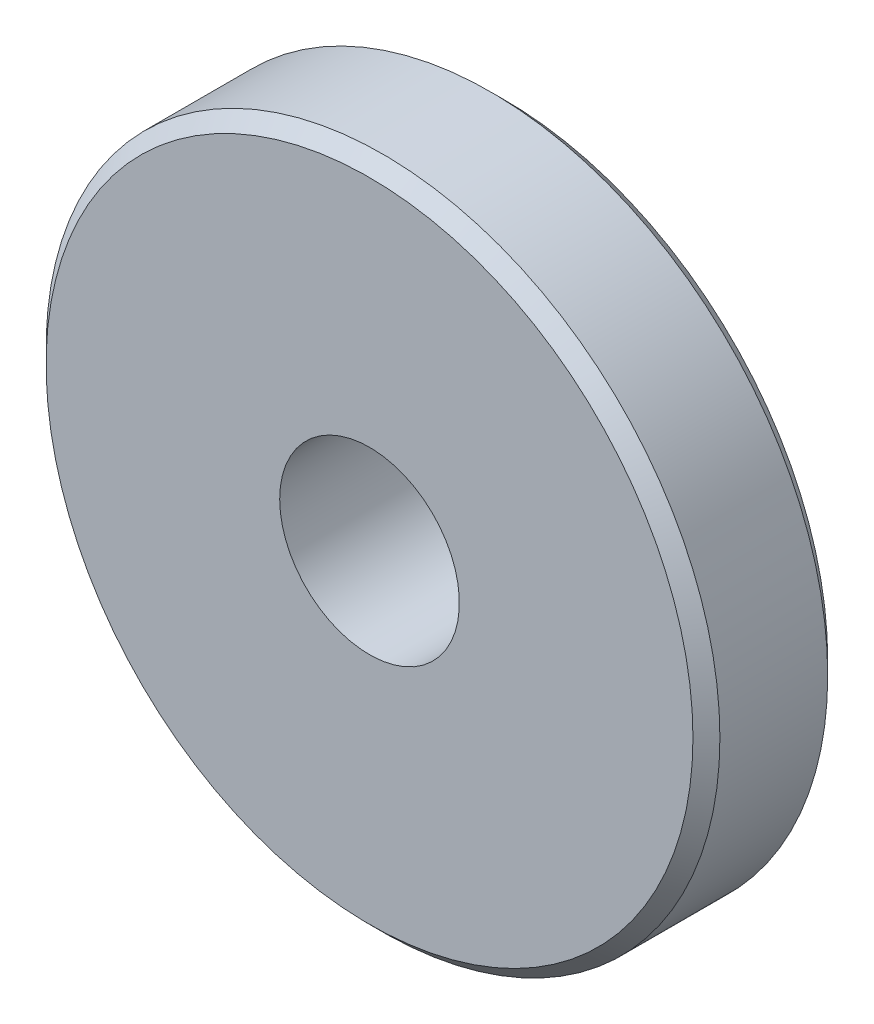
ISO-10303-21;
HEADER;
FILE_DESCRIPTION(('STEP AP214'),'2;1');
FILE_NAME('part.step','',(''),(''),'','','');
FILE_SCHEMA(('AUTOMOTIVE_DESIGN { 1 0 10303 214 1 1 1 1 }'));
ENDSEC;
DATA;
#1=APPLICATION_CONTEXT('core data for automotive mechanical design processes');
#2=APPLICATION_PROTOCOL_DEFINITION('international standard','automotive_design',2000,#1);
#3=PRODUCT_CONTEXT('',#1,'mechanical');
#4=PRODUCT('Part','Part','',(#3));
#5=PRODUCT_RELATED_PRODUCT_CATEGORY('part','',(#4));
#6=PRODUCT_DEFINITION_FORMATION('','',#4);
#7=PRODUCT_DEFINITION_CONTEXT('part definition',#1,'design');
#8=PRODUCT_DEFINITION('design','',#6,#7);
#9=PRODUCT_DEFINITION_SHAPE('','',#8);
#10=(LENGTH_UNIT() NAMED_UNIT(*) SI_UNIT(.MILLI.,.METRE.));
#11=(NAMED_UNIT(*) PLANE_ANGLE_UNIT() SI_UNIT($,.RADIAN.));
#12=(NAMED_UNIT(*) SI_UNIT($,.STERADIAN.) SOLID_ANGLE_UNIT());
#13=UNCERTAINTY_MEASURE_WITH_UNIT(LENGTH_MEASURE(1.E-05),#10,'distance_accuracy_value','');
#14=(GEOMETRIC_REPRESENTATION_CONTEXT(3) GLOBAL_UNCERTAINTY_ASSIGNED_CONTEXT((#13)) GLOBAL_UNIT_ASSIGNED_CONTEXT((#10,
#11,#12)) REPRESENTATION_CONTEXT('',''));
#15=CARTESIAN_POINT('',(0.,0.,0.));
#16=DIRECTION('',(0.,0.,1.));
#17=DIRECTION('',(1.,0.,0.));
#18=AXIS2_PLACEMENT_3D('',#15,#16,#17);
#19=CARTESIAN_POINT('',(0.,0.,2.));
#20=DIRECTION('',(0.,0.,-1.));
#21=DIRECTION('',(-1.,0.,0.));
#22=AXIS2_PLACEMENT_3D('',#19,#20,#21);
#23=CYLINDRICAL_SURFACE('',#22,8.);
#24=CARTESIAN_POINT('',(0.,0.,1.51));
#25=DIRECTION('',(0.,0.,1.));
#26=DIRECTION('',(1.,0.,0.));
#27=AXIS2_PLACEMENT_3D('',#24,#25,#26);
#28=CIRCLE('',#27,8.);
#29=CARTESIAN_POINT('',(8.,0.,1.51));
#30=VERTEX_POINT('',#29);
#31=EDGE_CURVE('E8',#30,#30,#28,.F.);
#32=ORIENTED_EDGE('',*,*,#31,.T.);
#33=EDGE_LOOP('',(#32));
#34=FACE_BOUND('',#33,.T.);
#35=CARTESIAN_POINT('',(0.,0.,0.));
#36=DIRECTION('',(0.,0.,1.));
#37=DIRECTION('',(1.,0.,0.));
#38=AXIS2_PLACEMENT_3D('',#35,#36,#37);
#39=CIRCLE('',#38,8.);
#40=CARTESIAN_POINT('',(8.,0.,0.));
#41=VERTEX_POINT('',#40);
#42=EDGE_CURVE('E38',#41,#41,#39,.T.);
#43=ORIENTED_EDGE('',*,*,#42,.T.);
#44=EDGE_LOOP('',(#43));
#45=FACE_BOUND('',#44,.T.);
#46=ADVANCED_FACE('F12',(#34,#45),#23,.T.);
#47=CARTESIAN_POINT('',(0.,0.,0.));
#48=DIRECTION('',(0.,0.,1.));
#49=DIRECTION('',(1.,0.,0.));
#50=AXIS2_PLACEMENT_3D('',#47,#48,#49);
#51=PLANE('',#50);
#52=CARTESIAN_POINT('',(0.,0.,0.));
#53=DIRECTION('',(0.,0.,-1.));
#54=DIRECTION('',(-1.,0.,0.));
#55=AXIS2_PLACEMENT_3D('',#52,#53,#54);
#56=CIRCLE('',#55,4.);
#57=CARTESIAN_POINT('',(-4.,0.,0.));
#58=VERTEX_POINT('',#57);
#59=EDGE_CURVE('E42',#58,#58,#56,.T.);
#60=ORIENTED_EDGE('',*,*,#59,.F.);
#61=EDGE_LOOP('',(#60));
#62=FACE_BOUND('',#61,.T.);
#63=ORIENTED_EDGE('',*,*,#42,.F.);
#64=EDGE_LOOP('',(#63));
#65=FACE_BOUND('',#64,.T.);
#66=ADVANCED_FACE('F57',(#62,#65),#51,.F.);
#67=CARTESIAN_POINT('',(0.,0.,2.));
#68=DIRECTION('',(0.,0.,1.));
#69=DIRECTION('',(1.,0.,0.));
#70=AXIS2_PLACEMENT_3D('',#67,#68,#69);
#71=PLANE('',#70);
#72=CARTESIAN_POINT('',(0.,0.,2.));
#73=DIRECTION('',(0.,0.,1.));
#74=DIRECTION('',(1.,0.,0.));
#75=AXIS2_PLACEMENT_3D('',#72,#73,#74);
#76=CIRCLE('',#75,8.49);
#77=CARTESIAN_POINT('',(8.49,0.,2.));
#78=VERTEX_POINT('',#77);
#79=EDGE_CURVE('E19',#78,#78,#76,.T.);
#80=ORIENTED_EDGE('',*,*,#79,.T.);
#81=EDGE_LOOP('',(#80));
#82=FACE_BOUND('',#81,.T.);
#83=CARTESIAN_POINT('',(0.,0.,2.));
#84=DIRECTION('',(0.,0.,1.));
#85=DIRECTION('',(1.,0.,0.));
#86=AXIS2_PLACEMENT_3D('',#83,#84,#85);
#87=CIRCLE('',#86,14.4);
#88=CARTESIAN_POINT('',(14.4,0.,2.));
#89=VERTEX_POINT('',#88);
#90=EDGE_CURVE('E27',#89,#89,#87,.F.);
#91=ORIENTED_EDGE('',*,*,#90,.T.);
#92=EDGE_LOOP('',(#91));
#93=FACE_BOUND('',#92,.T.);
#94=ADVANCED_FACE('F60',(#82,#93),#71,.F.);
#95=CARTESIAN_POINT('',(0.,0.,8.));
#96=DIRECTION('',(0.,0.,-1.));
#97=DIRECTION('',(-1.,0.,0.));
#98=AXIS2_PLACEMENT_3D('',#95,#96,#97);
#99=CYLINDRICAL_SURFACE('',#98,15.);
#100=CARTESIAN_POINT('',(0.,0.,2.6));
#101=DIRECTION('',(0.,0.,1.));
#102=DIRECTION('',(1.,0.,0.));
#103=AXIS2_PLACEMENT_3D('',#100,#101,#102);
#104=CIRCLE('',#103,15.);
#105=CARTESIAN_POINT('',(15.,0.,2.6));
#106=VERTEX_POINT('',#105);
#107=EDGE_CURVE('E32',#106,#106,#104,.T.);
#108=ORIENTED_EDGE('',*,*,#107,.T.);
#109=EDGE_LOOP('',(#108));
#110=FACE_BOUND('',#109,.T.);
#111=CARTESIAN_POINT('',(0.,0.,7.4));
#112=DIRECTION('',(0.,0.,1.));
#113=DIRECTION('',(1.,0.,0.));
#114=AXIS2_PLACEMENT_3D('',#111,#112,#113);
#115=CIRCLE('',#114,15.);
#116=CARTESIAN_POINT('',(15.,0.,7.4));
#117=VERTEX_POINT('',#116);
#118=EDGE_CURVE('E35',#117,#117,#115,.F.);
#119=ORIENTED_EDGE('',*,*,#118,.T.);
#120=EDGE_LOOP('',(#119));
#121=FACE_BOUND('',#120,.T.);
#122=ADVANCED_FACE('F87',(#110,#121),#99,.T.);
#123=CARTESIAN_POINT('',(0.,0.,8.));
#124=DIRECTION('',(0.,0.,1.));
#125=DIRECTION('',(1.,0.,0.));
#126=AXIS2_PLACEMENT_3D('',#123,#124,#125);
#127=PLANE('',#126);
#128=CARTESIAN_POINT('',(0.,0.,8.));
#129=DIRECTION('',(0.,0.,1.));
#130=DIRECTION('',(1.,0.,0.));
#131=AXIS2_PLACEMENT_3D('',#128,#129,#130);
#132=CIRCLE('',#131,14.4);
#133=CARTESIAN_POINT('',(14.4,0.,8.));
#134=VERTEX_POINT('',#133);
#135=EDGE_CURVE('E23',#134,#134,#132,.T.);
#136=ORIENTED_EDGE('',*,*,#135,.T.);
#137=EDGE_LOOP('',(#136));
#138=FACE_BOUND('',#137,.T.);
#139=CARTESIAN_POINT('',(0.,0.,8.));
#140=DIRECTION('',(0.,0.,-1.));
#141=DIRECTION('',(-1.,0.,0.));
#142=AXIS2_PLACEMENT_3D('',#139,#140,#141);
#143=CIRCLE('',#142,4.);
#144=CARTESIAN_POINT('',(-4.,0.,8.));
#145=VERTEX_POINT('',#144);
#146=EDGE_CURVE('E41',#145,#145,#143,.T.);
#147=ORIENTED_EDGE('',*,*,#146,.T.);
#148=EDGE_LOOP('',(#147));
#149=FACE_BOUND('',#148,.T.);
#150=ADVANCED_FACE('F48',(#138,#149),#127,.T.);
#151=CARTESIAN_POINT('',(0.,0.,8.));
#152=DIRECTION('',(0.,0.,-1.));
#153=DIRECTION('',(-1.,0.,0.));
#154=AXIS2_PLACEMENT_3D('',#151,#152,#153);
#155=CYLINDRICAL_SURFACE('',#154,4.);
#156=ORIENTED_EDGE('',*,*,#146,.F.);
#157=EDGE_LOOP('',(#156));
#158=FACE_BOUND('',#157,.T.);
#159=ORIENTED_EDGE('',*,*,#59,.T.);
#160=EDGE_LOOP('',(#159));
#161=FACE_BOUND('',#160,.T.);
#162=ADVANCED_FACE('F50',(#158,#161),#155,.F.);
#163=CARTESIAN_POINT('',(0.,0.,2.6));
#164=DIRECTION('',(0.,0.,1.));
#165=DIRECTION('',(1.,0.,0.));
#166=AXIS2_PLACEMENT_3D('',#163,#164,#165);
#167=CONICAL_SURFACE('',#166,15.,0.78539816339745);
#168=ORIENTED_EDGE('',*,*,#90,.F.);
#169=EDGE_LOOP('',(#168));
#170=FACE_BOUND('',#169,.T.);
#171=ORIENTED_EDGE('',*,*,#107,.F.);
#172=EDGE_LOOP('',(#171));
#173=FACE_BOUND('',#172,.T.);
#174=ADVANCED_FACE('F53',(#170,#173),#167,.T.);
#175=CARTESIAN_POINT('',(0.,0.,8.));
#176=DIRECTION('',(0.,0.,-1.));
#177=DIRECTION('',(-1.,0.,0.));
#178=AXIS2_PLACEMENT_3D('',#175,#176,#177);
#179=CONICAL_SURFACE('',#178,14.4,0.785398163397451);
#180=ORIENTED_EDGE('',*,*,#118,.F.);
#181=EDGE_LOOP('',(#180));
#182=FACE_BOUND('',#181,.T.);
#183=ORIENTED_EDGE('',*,*,#135,.F.);
#184=EDGE_LOOP('',(#183));
#185=FACE_BOUND('',#184,.T.);
#186=ADVANCED_FACE('F73',(#182,#185),#179,.T.);
#187=CARTESIAN_POINT('',(0.,0.,1.51));
#188=DIRECTION('',(0.,0.,1.));
#189=DIRECTION('',(1.,0.,0.));
#190=AXIS2_PLACEMENT_3D('',#187,#188,#189);
#191=TOROIDAL_SURFACE('',#190,8.49,0.49);
#192=ORIENTED_EDGE('',*,*,#31,.F.);
#193=EDGE_LOOP('',(#192));
#194=FACE_BOUND('',#193,.T.);
#195=ORIENTED_EDGE('',*,*,#79,.F.);
#196=EDGE_LOOP('',(#195));
#197=FACE_BOUND('',#196,.T.);
#198=ADVANCED_FACE('F14',(#194,#197),#191,.F.);
#199=CLOSED_SHELL('',(#46,#66,#94,#122,#150,#162,#174,#186,#198));
#200=MANIFOLD_SOLID_BREP('B1',#199);
#201=ADVANCED_BREP_SHAPE_REPRESENTATION('',(#18,#200),#14);
#202=SHAPE_DEFINITION_REPRESENTATION(#9,#201);
ENDSEC;
END-ISO-10303-21;
